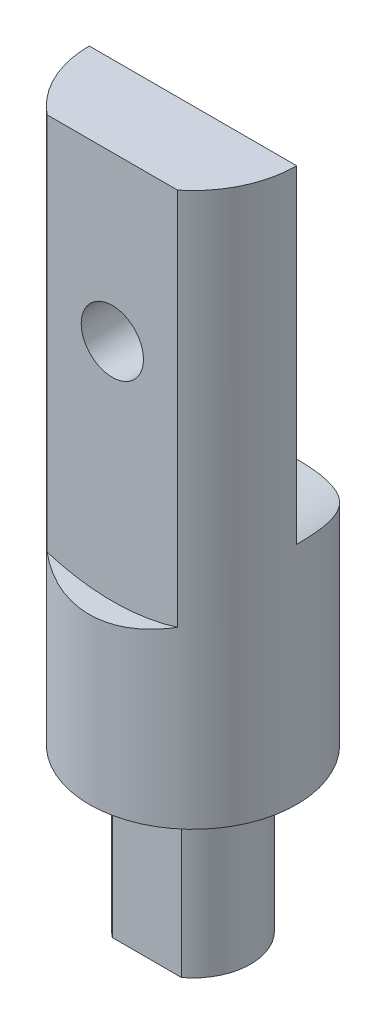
ISO-10303-21;
HEADER;
FILE_DESCRIPTION(('STEP AP214'),'2;1');
FILE_NAME('part.step','',(''),(''),'','','');
FILE_SCHEMA(('AUTOMOTIVE_DESIGN { 1 0 10303 214 1 1 1 1 }'));
ENDSEC;
DATA;
#1=APPLICATION_CONTEXT('core data for automotive mechanical design processes');
#2=APPLICATION_PROTOCOL_DEFINITION('international standard','automotive_design',2000,#1);
#3=PRODUCT_CONTEXT('',#1,'mechanical');
#4=PRODUCT('Part','Part','',(#3));
#5=PRODUCT_RELATED_PRODUCT_CATEGORY('part','',(#4));
#6=PRODUCT_DEFINITION_FORMATION('','',#4);
#7=PRODUCT_DEFINITION_CONTEXT('part definition',#1,'design');
#8=PRODUCT_DEFINITION('design','',#6,#7);
#9=PRODUCT_DEFINITION_SHAPE('','',#8);
#10=(LENGTH_UNIT() NAMED_UNIT(*) SI_UNIT(.MILLI.,.METRE.));
#11=(NAMED_UNIT(*) PLANE_ANGLE_UNIT() SI_UNIT($,.RADIAN.));
#12=(NAMED_UNIT(*) SI_UNIT($,.STERADIAN.) SOLID_ANGLE_UNIT());
#13=UNCERTAINTY_MEASURE_WITH_UNIT(LENGTH_MEASURE(1.E-05),#10,'distance_accuracy_value','');
#14=(GEOMETRIC_REPRESENTATION_CONTEXT(3) GLOBAL_UNCERTAINTY_ASSIGNED_CONTEXT((#13)) GLOBAL_UNIT_ASSIGNED_CONTEXT((#10,
#11,#12)) REPRESENTATION_CONTEXT('',''));
#15=CARTESIAN_POINT('',(0.,0.,0.));
#16=DIRECTION('',(0.,0.,1.));
#17=DIRECTION('',(1.,0.,0.));
#18=AXIS2_PLACEMENT_3D('',#15,#16,#17);
#19=CARTESIAN_POINT('',(0.,24.,0.));
#20=DIRECTION('',(0.,-1.,0.));
#21=DIRECTION('',(0.,0.,-1.));
#22=AXIS2_PLACEMENT_3D('',#19,#20,#21);
#23=CYLINDRICAL_SURFACE('',#22,4.5);
#24=CARTESIAN_POINT('',(0.,0.,0.));
#25=DIRECTION('',(0.,1.,0.));
#26=DIRECTION('',(0.,0.,1.));
#27=AXIS2_PLACEMENT_3D('',#24,#25,#26);
#28=CIRCLE('',#27,4.5);
#29=CARTESIAN_POINT('',(0.,0.,4.5));
#30=VERTEX_POINT('',#29);
#31=EDGE_CURVE('E153',#30,#30,#28,.T.);
#32=ORIENTED_EDGE('',*,*,#31,.T.);
#33=EDGE_LOOP('',(#32));
#34=FACE_BOUND('',#33,.T.);
#35=CARTESIAN_POINT('',(-2.82842712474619,7.57328551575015,3.5));
#36=CARTESIAN_POINT('',(-2.73477703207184,7.5439040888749,3.57568711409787));
#37=CARTESIAN_POINT('',(-2.63795159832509,7.5151475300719,3.64771357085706));
#38=CARTESIAN_POINT('',(-2.4384147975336,7.4595224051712,3.78400925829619));
#39=CARTESIAN_POINT('',(-2.33570099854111,7.43265462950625,3.84827524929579));
#40=CARTESIAN_POINT('',(-2.12462415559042,7.3813963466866,3.96872543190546));
#41=CARTESIAN_POINT('',(-2.01624553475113,7.35701327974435,4.02488554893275));
#42=CARTESIAN_POINT('',(-1.79473997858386,7.31141985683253,4.12841988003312));
#43=CARTESIAN_POINT('',(-1.68161368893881,7.29020907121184,4.17579528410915));
#44=CARTESIAN_POINT('',(-1.45093592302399,7.25144073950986,4.26145148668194));
#45=CARTESIAN_POINT('',(-1.33337156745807,7.23389497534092,4.29970300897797));
#46=CARTESIAN_POINT('',(-1.09497804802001,7.20301402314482,4.36650251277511));
#47=CARTESIAN_POINT('',(-0.974149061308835,7.18967860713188,4.39505101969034));
#48=CARTESIAN_POINT('',(-0.730356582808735,7.16760826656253,4.44206732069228));
#49=CARTESIAN_POINT('',(-0.607397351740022,7.15886505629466,4.46055327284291));
#50=CARTESIAN_POINT('',(-0.360128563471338,7.14619250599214,4.48728968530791));
#51=CARTESIAN_POINT('',(-0.235819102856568,7.14226282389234,4.49554087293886));
#52=CARTESIAN_POINT('',(0.00556519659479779,7.13941822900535,4.50151641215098));
#53=CARTESIAN_POINT('',(0.122622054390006,7.140213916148,4.49984825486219));
#54=CARTESIAN_POINT('',(0.356179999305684,7.14613117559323,4.4874065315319));
#55=CARTESIAN_POINT('',(0.472680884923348,7.15125421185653,4.47662988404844));
#56=CARTESIAN_POINT('',(0.704281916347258,7.16570288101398,4.44608038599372));
#57=CARTESIAN_POINT('',(0.819381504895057,7.1750301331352,4.42630406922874));
#58=CARTESIAN_POINT('',(1.04734080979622,7.19764926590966,4.37797601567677));
#59=CARTESIAN_POINT('',(1.16019971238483,7.21094255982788,4.34942115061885));
#60=CARTESIAN_POINT('',(1.49125217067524,7.25590423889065,4.2518845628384));
#61=CARTESIAN_POINT('',(1.70522473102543,7.29287529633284,4.17058333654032));
#62=CARTESIAN_POINT('',(2.11636835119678,7.37774444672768,3.97775552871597));
#63=CARTESIAN_POINT('',(2.31355702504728,7.42563088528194,3.86626116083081));
#64=CARTESIAN_POINT('',(2.55711467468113,7.49244360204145,3.70348649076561));
#65=CARTESIAN_POINT('',(2.61278258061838,7.50828341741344,3.66442218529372));
#66=CARTESIAN_POINT('',(2.72210007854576,7.54044509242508,3.5839588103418));
#67=CARTESIAN_POINT('',(2.77575308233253,7.55676604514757,3.54256401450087));
#68=CARTESIAN_POINT('',(2.82842712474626,7.57328551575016,3.5000000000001));
#69=B_SPLINE_CURVE_WITH_KNOTS('',3,(#35,#36,#37,#38,#39,#40,#41,#42,#43,#44,#45,#46,#47,#48,#49,
#50,#51,#52,#53,#54,#55,#56,#57,#58,#59,#60,#61,#62,#63,#64,#65,#66,#67,#68),.UNSPECIFIED.,.F.,
.F.,(4,2,2,2,2,2,2,2,2,2,2,2,2,2,2,2,4),(0.,0.371760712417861,0.743676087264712,
1.11667427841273,1.4896219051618,1.86375059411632,2.23785902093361,2.61129010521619,
2.98469465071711,3.33547612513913,3.68637631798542,4.03741177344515,4.38857246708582,
5.08099666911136,5.77268500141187,5.98211961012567,6.19118193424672),.UNSPECIFIED.);
#70=CARTESIAN_POINT('',(-2.82842712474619,7.57328551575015,3.5));
#71=VERTEX_POINT('',#70);
#72=CARTESIAN_POINT('',(2.82842712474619,7.57328551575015,3.5));
#73=VERTEX_POINT('',#72);
#74=EDGE_CURVE('E11',#71,#73,#69,.T.);
#75=ORIENTED_EDGE('',*,*,#74,.F.);
#76=DIRECTION('',(0.,1.,0.));
#77=VECTOR('',#76,1.);
#78=CARTESIAN_POINT('',(-2.82842712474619,16.,3.5));
#79=LINE('',#78,#77);
#80=CARTESIAN_POINT('',(-2.82842712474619,24.,3.5));
#81=VERTEX_POINT('',#80);
#82=EDGE_CURVE('E104',#71,#81,#79,.T.);
#83=ORIENTED_EDGE('',*,*,#82,.T.);
#84=CARTESIAN_POINT('',(0.,24.,0.));
#85=DIRECTION('',(0.,1.,0.));
#86=DIRECTION('',(0.,0.,1.));
#87=AXIS2_PLACEMENT_3D('',#84,#85,#86);
#88=CIRCLE('',#87,4.5);
#89=CARTESIAN_POINT('',(-4.5,24.,0.));
#90=VERTEX_POINT('',#89);
#91=EDGE_CURVE('E155',#90,#81,#88,.T.);
#92=ORIENTED_EDGE('',*,*,#91,.F.);
#93=DIRECTION('',(0.,1.,0.));
#94=VECTOR('',#93,1.);
#95=CARTESIAN_POINT('',(-4.5,16.,0.));
#96=LINE('',#95,#94);
#97=CARTESIAN_POINT('',(-4.5,9.77777802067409,0.));
#98=VERTEX_POINT('',#97);
#99=EDGE_CURVE('E56',#98,#90,#96,.T.);
#100=ORIENTED_EDGE('',*,*,#99,.F.);
#101=CARTESIAN_POINT('',(4.5,9.77777802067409,0.));
#102=CARTESIAN_POINT('',(4.50002255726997,9.77781675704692,-0.116569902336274));
#103=CARTESIAN_POINT('',(4.49547132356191,9.77491778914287,-0.233117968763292));
#104=CARTESIAN_POINT('',(4.47739928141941,9.76353705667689,-0.465160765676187));
#105=CARTESIAN_POINT('',(4.46388492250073,9.75505930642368,-0.580656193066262));
#106=CARTESIAN_POINT('',(4.42817962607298,9.73288454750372,-0.809015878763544));
#107=CARTESIAN_POINT('',(4.40604518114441,9.71922153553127,-0.921892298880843));
#108=CARTESIAN_POINT('',(4.35340961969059,9.68719632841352,-1.14497770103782));
#109=CARTESIAN_POINT('',(4.32290733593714,9.66883347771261,-1.2551863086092));
#110=CARTESIAN_POINT('',(4.21953910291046,9.60771372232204,-1.58018646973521));
#111=CARTESIAN_POINT('',(4.13468464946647,9.55884143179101,-1.79014607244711));
#112=CARTESIAN_POINT('',(3.93590831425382,9.45040770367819,-2.19300968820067));
#113=CARTESIAN_POINT('',(3.82193469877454,9.39082729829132,-2.38588251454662));
#114=CARTESIAN_POINT('',(3.55566904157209,9.26091551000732,-2.76886299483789));
#115=CARTESIAN_POINT('',(3.40077988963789,9.19010004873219,-2.95700129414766));
#116=CARTESIAN_POINT('',(3.06235103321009,9.04956804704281,-3.30621981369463));
#117=CARTESIAN_POINT('',(2.87880276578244,8.97985184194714,-3.46729191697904));
#118=CARTESIAN_POINT('',(2.57671661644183,8.8783833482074,-3.69160946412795));
#119=CARTESIAN_POINT('',(2.46705949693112,8.84390618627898,-3.76579812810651));
#120=CARTESIAN_POINT('',(2.24094884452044,8.77812107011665,-3.90457718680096));
#121=CARTESIAN_POINT('',(2.12449807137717,8.7468118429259,-3.96917144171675));
#122=CARTESIAN_POINT('',(1.88553425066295,8.68826770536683,-4.08810109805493));
#123=CARTESIAN_POINT('',(1.76302302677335,8.66103157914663,-4.14243956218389));
#124=CARTESIAN_POINT('',(1.51277519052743,8.61144246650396,-4.24022982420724));
#125=CARTESIAN_POINT('',(1.3850392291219,8.58908887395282,-4.28368297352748));
#126=CARTESIAN_POINT('',(1.13568378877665,8.55152307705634,-4.35611273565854));
#127=CARTESIAN_POINT('',(1.01438215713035,8.53588522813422,-4.38596387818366));
#128=CARTESIAN_POINT('',(0.769183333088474,8.50978846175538,-4.43553792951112));
#129=CARTESIAN_POINT('',(0.64528643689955,8.49932895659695,-4.4552619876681));
#130=CARTESIAN_POINT('',(0.396006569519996,8.48389739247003,-4.48429666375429));
#131=CARTESIAN_POINT('',(0.270624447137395,8.47892233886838,-4.49361296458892));
#132=CARTESIAN_POINT('',(0.0194272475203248,8.47459873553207,-4.50171193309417));
#133=CARTESIAN_POINT('',(-0.106387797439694,8.47524977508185,-4.500495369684));
#134=CARTESIAN_POINT('',(-0.344858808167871,8.48181300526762,-4.48819368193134));
#135=CARTESIAN_POINT('',(-0.457582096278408,8.48719690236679,-4.47809945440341));
#136=CARTESIAN_POINT('',(-0.681690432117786,8.50238178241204,-4.44950146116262));
#137=CARTESIAN_POINT('',(-0.793075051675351,8.51218414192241,-4.43099507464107));
#138=CARTESIAN_POINT('',(-1.01367311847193,8.53597319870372,-4.38578784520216));
#139=CARTESIAN_POINT('',(-1.12288732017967,8.54995841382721,-4.35908990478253));
#140=CARTESIAN_POINT('',(-1.33851175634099,8.58179013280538,-4.29778681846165));
#141=CARTESIAN_POINT('',(-1.4449208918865,8.59963812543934,-4.26317862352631));
#142=CARTESIAN_POINT('',(-1.76139598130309,8.65886504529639,-4.14707915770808));
#143=CARTESIAN_POINT('',(-1.96627664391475,8.7056529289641,-4.05381688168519));
#144=CARTESIAN_POINT('',(-2.35780305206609,8.80957459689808,-3.83936592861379));
#145=CARTESIAN_POINT('',(-2.54444251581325,8.86671192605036,-3.71816767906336));
#146=CARTESIAN_POINT('',(-2.91502102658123,8.99314237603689,-3.43688462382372));
#147=CARTESIAN_POINT('',(-3.09667468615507,9.06308160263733,-3.27407117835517));
#148=CARTESIAN_POINT('',(-3.43142748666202,9.20372678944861,-2.92140155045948));
#149=CARTESIAN_POINT('',(-3.58449446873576,9.27443351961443,-2.73151533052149));
#150=CARTESIAN_POINT('',(-3.86998198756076,9.41498329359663,-2.31141427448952));
#151=CARTESIAN_POINT('',(-3.99975357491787,9.48429996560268,-2.07918457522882));
#152=CARTESIAN_POINT('',(-4.16286647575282,9.57539478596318,-1.71414978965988));
#153=CARTESIAN_POINT('',(-4.21195715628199,9.6035980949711,-1.58978079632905));
#154=CARTESIAN_POINT('',(-4.29913008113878,9.65460950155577,-1.33620519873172));
#155=CARTESIAN_POINT('',(-4.33721696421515,9.67741987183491,-1.20700065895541));
#156=CARTESIAN_POINT('',(-4.41242278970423,9.72302437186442,-0.901492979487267));
#157=CARTESIAN_POINT('',(-4.44510305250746,9.7433454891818,-0.723676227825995));
#158=CARTESIAN_POINT('',(-4.47795377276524,9.76388901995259,-0.454084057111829));
#159=CARTESIAN_POINT('',(-4.48620926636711,9.76908083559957,-0.363580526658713));
#160=CARTESIAN_POINT('',(-4.49723509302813,9.77603066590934,-0.182063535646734));
#161=CARTESIAN_POINT('',(-4.50000265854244,9.77778694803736,-0.0910498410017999));
#162=CARTESIAN_POINT('',(-4.5,9.77777802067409,0.));
#163=B_SPLINE_CURVE_WITH_KNOTS('',3,(#101,#102,#103,#104,#105,#106,#107,#108,#109,#110,#111,
#112,#113,#114,#115,#116,#117,#118,#119,#120,#121,#122,#123,#124,#125,#126,#127,#128,#129,#130,
#131,#132,#133,#134,#135,#136,#137,#138,#139,#140,#141,#142,#143,#144,#145,#146,#147,#148,#149,
#150,#151,#152,#153,#154,#155,#156,#157,#158,#159,#160,#161,#162),.UNSPECIFIED.,.F.,.F.,(4,2,2,
2,2,2,2,2,2,2,2,2,2,2,2,2,2,2,2,2,2,2,2,2,2,2,2,2,2,2,4),(0.,0.349549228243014,
0.698847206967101,1.04589353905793,1.39298830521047,2.08478379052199,2.77781698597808,
3.5360876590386,4.29458532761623,4.70456350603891,5.11437628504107,5.52406648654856,
5.93370579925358,6.31087178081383,6.68799494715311,7.06491209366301,7.44180172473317,
7.78130525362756,8.12091462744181,8.46040380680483,8.80002406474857,9.48667631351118,
10.1735642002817,10.9316540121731,11.6905915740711,12.5105397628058,12.9199528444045,
13.3291930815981,13.8730366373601,14.1459195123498,14.4189399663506),.UNSPECIFIED.);
#164=CARTESIAN_POINT('',(4.5,9.77777802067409,0.));
#165=VERTEX_POINT('',#164);
#166=EDGE_CURVE('E49',#165,#98,#163,.T.);
#167=ORIENTED_EDGE('',*,*,#166,.F.);
#168=DIRECTION('',(0.,1.,0.));
#169=VECTOR('',#168,1.);
#170=CARTESIAN_POINT('',(4.5,16.,0.));
#171=LINE('',#170,#169);
#172=CARTESIAN_POINT('',(4.5,24.,0.));
#173=VERTEX_POINT('',#172);
#174=EDGE_CURVE('E130',#165,#173,#171,.T.);
#175=ORIENTED_EDGE('',*,*,#174,.T.);
#176=CARTESIAN_POINT('',(2.82842712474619,24.,3.5));
#177=VERTEX_POINT('',#176);
#178=EDGE_CURVE('E122',#177,#173,#88,.T.);
#179=ORIENTED_EDGE('',*,*,#178,.F.);
#180=DIRECTION('',(0.,1.,0.));
#181=VECTOR('',#180,1.);
#182=CARTESIAN_POINT('',(2.82842712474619,16.,3.5));
#183=LINE('',#182,#181);
#184=EDGE_CURVE('E64',#73,#177,#183,.T.);
#185=ORIENTED_EDGE('',*,*,#184,.F.);
#186=EDGE_LOOP('',(#75,#83,#92,#100,#167,#175,#179,#185));
#187=FACE_BOUND('',#186,.T.);
#188=ADVANCED_FACE('F36',(#34,#187),#23,.T.);
#189=CARTESIAN_POINT('',(0.,16.9015566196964,4.5));
#190=DIRECTION('',(0.,0.,-1.));
#191=DIRECTION('',(-1.,0.,0.));
#192=AXIS2_PLACEMENT_3D('',#189,#190,#191);
#193=CYLINDRICAL_SURFACE('',#192,1.35);
#194=CARTESIAN_POINT('',(0.,16.9015566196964,0.));
#195=DIRECTION('',(0.,0.,-1.));
#196=DIRECTION('',(-1.,0.,0.));
#197=AXIS2_PLACEMENT_3D('',#194,#195,#196);
#198=CIRCLE('',#197,1.35);
#199=CARTESIAN_POINT('',(-1.35,16.9015566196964,0.));
#200=VERTEX_POINT('',#199);
#201=EDGE_CURVE('E317',#200,#200,#198,.T.);
#202=ORIENTED_EDGE('',*,*,#201,.T.);
#203=EDGE_LOOP('',(#202));
#204=FACE_BOUND('',#203,.T.);
#205=CARTESIAN_POINT('',(0.,16.9015566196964,3.5));
#206=DIRECTION('',(0.,0.,-1.));
#207=DIRECTION('',(-1.,0.,0.));
#208=AXIS2_PLACEMENT_3D('',#205,#206,#207);
#209=CIRCLE('',#208,1.35);
#210=CARTESIAN_POINT('',(-1.35,16.9015566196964,3.5));
#211=VERTEX_POINT('',#210);
#212=EDGE_CURVE('E124',#211,#211,#209,.T.);
#213=ORIENTED_EDGE('',*,*,#212,.F.);
#214=EDGE_LOOP('',(#213));
#215=FACE_BOUND('',#214,.T.);
#216=ADVANCED_FACE('F175',(#204,#215),#193,.F.);
#217=CARTESIAN_POINT('',(0.,0.,0.));
#218=DIRECTION('',(0.,-1.,0.));
#219=DIRECTION('',(0.,0.,-1.));
#220=AXIS2_PLACEMENT_3D('',#217,#218,#219);
#221=CYLINDRICAL_SURFACE('',#220,2.5);
#222=CARTESIAN_POINT('',(0.,-7.,0.));
#223=DIRECTION('',(0.,-1.,0.));
#224=DIRECTION('',(0.,0.,-1.));
#225=AXIS2_PLACEMENT_3D('',#222,#223,#224);
#226=CIRCLE('',#225,2.5);
#227=CARTESIAN_POINT('',(1.5,-7.,-2.));
#228=VERTEX_POINT('',#227);
#229=CARTESIAN_POINT('',(1.5,-7.,2.));
#230=VERTEX_POINT('',#229);
#231=EDGE_CURVE('E150',#228,#230,#226,.T.);
#232=ORIENTED_EDGE('',*,*,#231,.F.);
#233=DIRECTION('',(0.,-1.,0.));
#234=VECTOR('',#233,1.);
#235=CARTESIAN_POINT('',(1.5,0.,-2.));
#236=LINE('',#235,#234);
#237=CARTESIAN_POINT('',(1.5,0.,-2.));
#238=VERTEX_POINT('',#237);
#239=EDGE_CURVE('E141',#228,#238,#236,.F.);
#240=ORIENTED_EDGE('',*,*,#239,.T.);
#241=CARTESIAN_POINT('',(0.,0.,0.));
#242=DIRECTION('',(0.,-1.,0.));
#243=DIRECTION('',(0.,0.,-1.));
#244=AXIS2_PLACEMENT_3D('',#241,#242,#243);
#245=CIRCLE('',#244,2.5);
#246=CARTESIAN_POINT('',(1.5,0.,2.));
#247=VERTEX_POINT('',#246);
#248=EDGE_CURVE('E145',#238,#247,#245,.T.);
#249=ORIENTED_EDGE('',*,*,#248,.T.);
#250=DIRECTION('',(0.,-1.,0.));
#251=VECTOR('',#250,1.);
#252=CARTESIAN_POINT('',(1.5,0.,2.));
#253=LINE('',#252,#251);
#254=EDGE_CURVE('E132',#247,#230,#253,.T.);
#255=ORIENTED_EDGE('',*,*,#254,.T.);
#256=EDGE_LOOP('',(#232,#240,#249,#255));
#257=FACE_BOUND('',#256,.T.);
#258=ADVANCED_FACE('F178',(#257),#221,.T.);
#259=CARTESIAN_POINT('',(-1.5,0.,2.));
#260=VERTEX_POINT('',#259);
#261=CARTESIAN_POINT('',(-1.5,0.,-2.));
#262=VERTEX_POINT('',#261);
#263=EDGE_CURVE('E149',#260,#262,#245,.T.);
#264=ORIENTED_EDGE('',*,*,#263,.T.);
#265=DIRECTION('',(0.,-1.,0.));
#266=VECTOR('',#265,1.);
#267=CARTESIAN_POINT('',(-1.5,0.,-2.));
#268=LINE('',#267,#266);
#269=CARTESIAN_POINT('',(-1.5,-7.,-2.));
#270=VERTEX_POINT('',#269);
#271=EDGE_CURVE('E138',#262,#270,#268,.T.);
#272=ORIENTED_EDGE('',*,*,#271,.T.);
#273=CARTESIAN_POINT('',(-1.5,-7.,2.));
#274=VERTEX_POINT('',#273);
#275=EDGE_CURVE('E144',#274,#270,#226,.T.);
#276=ORIENTED_EDGE('',*,*,#275,.F.);
#277=DIRECTION('',(0.,-1.,0.));
#278=VECTOR('',#277,1.);
#279=CARTESIAN_POINT('',(-1.5,0.,2.));
#280=LINE('',#279,#278);
#281=EDGE_CURVE('E135',#274,#260,#280,.F.);
#282=ORIENTED_EDGE('',*,*,#281,.T.);
#283=EDGE_LOOP('',(#264,#272,#276,#282));
#284=FACE_BOUND('',#283,.T.);
#285=ADVANCED_FACE('F198',(#284),#221,.T.);
#286=CARTESIAN_POINT('',(0.,-7.,0.));
#287=DIRECTION('',(0.,-1.,0.));
#288=DIRECTION('',(0.,0.,-1.));
#289=AXIS2_PLACEMENT_3D('',#286,#287,#288);
#290=PLANE('',#289);
#291=ORIENTED_EDGE('',*,*,#275,.T.);
#292=DIRECTION('',(1.,0.,0.));
#293=VECTOR('',#292,1.);
#294=CARTESIAN_POINT('',(0.,-7.,-2.));
#295=LINE('',#294,#293);
#296=EDGE_CURVE('E160',#270,#228,#295,.T.);
#297=ORIENTED_EDGE('',*,*,#296,.T.);
#298=ORIENTED_EDGE('',*,*,#231,.T.);
#299=DIRECTION('',(-1.,0.,0.));
#300=VECTOR('',#299,1.);
#301=CARTESIAN_POINT('',(0.,-7.,2.));
#302=LINE('',#301,#300);
#303=EDGE_CURVE('E148',#230,#274,#302,.T.);
#304=ORIENTED_EDGE('',*,*,#303,.T.);
#305=EDGE_LOOP('',(#291,#297,#298,#304));
#306=FACE_BOUND('',#305,.T.);
#307=ADVANCED_FACE('F194',(#306),#290,.T.);
#308=CARTESIAN_POINT('',(0.,24.,0.));
#309=DIRECTION('',(0.,1.,0.));
#310=DIRECTION('',(0.,0.,1.));
#311=AXIS2_PLACEMENT_3D('',#308,#309,#310);
#312=PLANE('',#311);
#313=DIRECTION('',(1.,0.,0.));
#314=VECTOR('',#313,1.);
#315=CARTESIAN_POINT('',(-4.5,24.,0.));
#316=LINE('',#315,#314);
#317=EDGE_CURVE('E113',#90,#173,#316,.T.);
#318=ORIENTED_EDGE('',*,*,#317,.F.);
#319=ORIENTED_EDGE('',*,*,#91,.T.);
#320=DIRECTION('',(-1.,0.,0.));
#321=VECTOR('',#320,1.);
#322=CARTESIAN_POINT('',(-2.82842712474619,24.,3.5));
#323=LINE('',#322,#321);
#324=EDGE_CURVE('E108',#177,#81,#323,.T.);
#325=ORIENTED_EDGE('',*,*,#324,.F.);
#326=ORIENTED_EDGE('',*,*,#178,.T.);
#327=EDGE_LOOP('',(#318,#319,#325,#326));
#328=FACE_BOUND('',#327,.T.);
#329=ADVANCED_FACE('F197',(#328),#312,.T.);
#330=CARTESIAN_POINT('',(0.,0.,0.));
#331=DIRECTION('',(0.,1.,0.));
#332=DIRECTION('',(0.,0.,1.));
#333=AXIS2_PLACEMENT_3D('',#330,#331,#332);
#334=PLANE('',#333);
#335=ORIENTED_EDGE('',*,*,#31,.F.);
#336=EDGE_LOOP('',(#335));
#337=FACE_BOUND('',#336,.T.);
#338=ORIENTED_EDGE('',*,*,#248,.F.);
#339=DIRECTION('',(1.,0.,0.));
#340=VECTOR('',#339,1.);
#341=CARTESIAN_POINT('',(-3.28879753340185,0.,-2.));
#342=LINE('',#341,#340);
#343=EDGE_CURVE('E129',#262,#238,#342,.T.);
#344=ORIENTED_EDGE('',*,*,#343,.F.);
#345=ORIENTED_EDGE('',*,*,#263,.F.);
#346=DIRECTION('',(-1.,0.,0.));
#347=VECTOR('',#346,1.);
#348=CARTESIAN_POINT('',(-3.28879753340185,0.,2.));
#349=LINE('',#348,#347);
#350=EDGE_CURVE('E127',#247,#260,#349,.T.);
#351=ORIENTED_EDGE('',*,*,#350,.F.);
#352=EDGE_LOOP('',(#338,#344,#345,#351));
#353=FACE_BOUND('',#352,.T.);
#354=ADVANCED_FACE('F192',(#337,#353),#334,.F.);
#355=CARTESIAN_POINT('',(-3.28879753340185,0.,2.));
#356=DIRECTION('',(0.,0.,1.));
#357=DIRECTION('',(1.,0.,0.));
#358=AXIS2_PLACEMENT_3D('',#355,#356,#357);
#359=PLANE('',#358);
#360=ORIENTED_EDGE('',*,*,#303,.F.);
#361=ORIENTED_EDGE('',*,*,#254,.F.);
#362=ORIENTED_EDGE('',*,*,#350,.T.);
#363=ORIENTED_EDGE('',*,*,#281,.F.);
#364=EDGE_LOOP('',(#360,#361,#362,#363));
#365=FACE_BOUND('',#364,.T.);
#366=ADVANCED_FACE('F188',(#365),#359,.T.);
#367=CARTESIAN_POINT('',(-3.28879753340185,0.,-2.));
#368=DIRECTION('',(0.,0.,-1.));
#369=DIRECTION('',(-1.,0.,0.));
#370=AXIS2_PLACEMENT_3D('',#367,#368,#369);
#371=PLANE('',#370);
#372=ORIENTED_EDGE('',*,*,#296,.F.);
#373=ORIENTED_EDGE('',*,*,#271,.F.);
#374=ORIENTED_EDGE('',*,*,#343,.T.);
#375=ORIENTED_EDGE('',*,*,#239,.F.);
#376=EDGE_LOOP('',(#372,#373,#374,#375));
#377=FACE_BOUND('',#376,.T.);
#378=ADVANCED_FACE('F184',(#377),#371,.T.);
#379=CARTESIAN_POINT('',(-2.82842712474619,16.,3.5));
#380=DIRECTION('',(0.,0.,-1.));
#381=DIRECTION('',(-1.,0.,0.));
#382=AXIS2_PLACEMENT_3D('',#379,#380,#381);
#383=PLANE('',#382);
#384=ORIENTED_EDGE('',*,*,#212,.T.);
#385=EDGE_LOOP('',(#384));
#386=FACE_BOUND('',#385,.T.);
#387=ORIENTED_EDGE('',*,*,#82,.F.);
#388=CARTESIAN_POINT('',(0.,16.5914859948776,3.5));
#389=DIRECTION('',(0.,0.,1.));
#390=DIRECTION('',(1.,0.,0.));
#391=AXIS2_PLACEMENT_3D('',#388,#389,#390);
#392=CIRCLE('',#391,9.45134592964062);
#393=EDGE_CURVE('E107',#71,#73,#392,.T.);
#394=ORIENTED_EDGE('',*,*,#393,.T.);
#395=ORIENTED_EDGE('',*,*,#184,.T.);
#396=ORIENTED_EDGE('',*,*,#324,.T.);
#397=EDGE_LOOP('',(#387,#394,#395,#396));
#398=FACE_BOUND('',#397,.T.);
#399=ADVANCED_FACE('F106',(#386,#398),#383,.F.);
#400=CARTESIAN_POINT('',(-4.5,16.,0.));
#401=DIRECTION('',(0.,0.,1.));
#402=DIRECTION('',(1.,0.,0.));
#403=AXIS2_PLACEMENT_3D('',#400,#401,#402);
#404=PLANE('',#403);
#405=ORIENTED_EDGE('',*,*,#174,.F.);
#406=CARTESIAN_POINT('',(0.,16.9015566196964,0.));
#407=DIRECTION('',(0.,0.,-1.));
#408=DIRECTION('',(-1.,0.,0.));
#409=AXIS2_PLACEMENT_3D('',#406,#407,#408);
#410=CIRCLE('',#409,8.42604423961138);
#411=EDGE_CURVE('E117',#165,#98,#410,.T.);
#412=ORIENTED_EDGE('',*,*,#411,.T.);
#413=ORIENTED_EDGE('',*,*,#99,.T.);
#414=ORIENTED_EDGE('',*,*,#317,.T.);
#415=EDGE_LOOP('',(#405,#412,#413,#414));
#416=FACE_BOUND('',#415,.T.);
#417=ORIENTED_EDGE('',*,*,#201,.F.);
#418=EDGE_LOOP('',(#417));
#419=FACE_BOUND('',#418,.T.);
#420=ADVANCED_FACE('F172',(#416,#419),#404,.F.);
#421=CARTESIAN_POINT('',(0.,16.9015566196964,-8.));
#422=DIRECTION('',(0.,0.,1.));
#423=DIRECTION('',(1.,0.,0.));
#424=AXIS2_PLACEMENT_3D('',#421,#422,#423);
#425=CYLINDRICAL_SURFACE('',#424,8.42604423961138);
#426=ORIENTED_EDGE('',*,*,#166,.T.);
#427=ORIENTED_EDGE('',*,*,#411,.F.);
#428=EDGE_LOOP('',(#426,#427));
#429=FACE_BOUND('',#428,.T.);
#430=ADVANCED_FACE('F168',(#429),#425,.F.);
#431=CARTESIAN_POINT('',(0.,16.5914859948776,11.5));
#432=DIRECTION('',(0.,0.,-1.));
#433=DIRECTION('',(-1.,0.,0.));
#434=AXIS2_PLACEMENT_3D('',#431,#432,#433);
#435=CYLINDRICAL_SURFACE('',#434,9.45134592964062);
#436=ORIENTED_EDGE('',*,*,#74,.T.);
#437=ORIENTED_EDGE('',*,*,#393,.F.);
#438=EDGE_LOOP('',(#436,#437));
#439=FACE_BOUND('',#438,.T.);
#440=ADVANCED_FACE('F116',(#439),#435,.F.);
#441=CLOSED_SHELL('',(#188,#216,#258,#285,#307,#329,#354,#366,#378,#399,#420,#430,#440));
#442=MANIFOLD_SOLID_BREP('B2',#441);
#443=ADVANCED_BREP_SHAPE_REPRESENTATION('',(#18,#442),#14);
#444=SHAPE_DEFINITION_REPRESENTATION(#9,#443);
ENDSEC;
END-ISO-10303-21;
